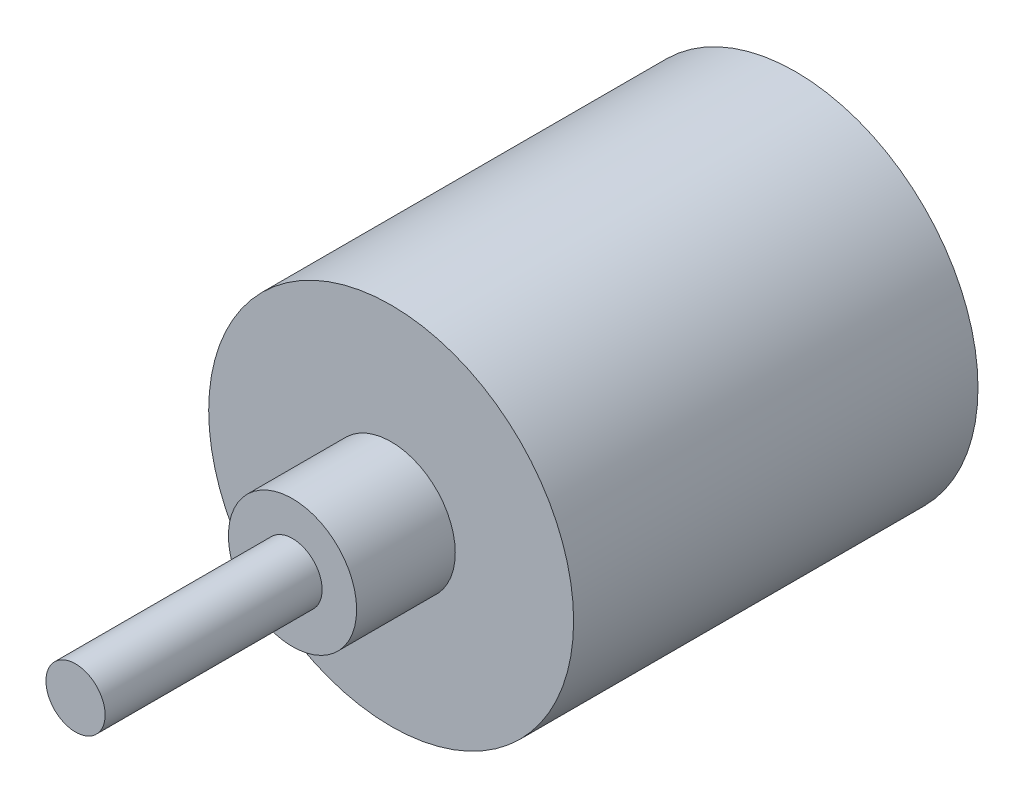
ISO-10303-21;
HEADER;
FILE_DESCRIPTION(('STEP AP214'),'2;1');
FILE_NAME('part.step','',(''),(''),'','','');
FILE_SCHEMA(('AUTOMOTIVE_DESIGN { 1 0 10303 214 1 1 1 1 }'));
ENDSEC;
DATA;
#1=APPLICATION_CONTEXT('core data for automotive mechanical design processes');
#2=APPLICATION_PROTOCOL_DEFINITION('international standard','automotive_design',2000,#1);
#3=PRODUCT_CONTEXT('',#1,'mechanical');
#4=PRODUCT('Part','Part','',(#3));
#5=PRODUCT_RELATED_PRODUCT_CATEGORY('part','',(#4));
#6=PRODUCT_DEFINITION_FORMATION('','',#4);
#7=PRODUCT_DEFINITION_CONTEXT('part definition',#1,'design');
#8=PRODUCT_DEFINITION('design','',#6,#7);
#9=PRODUCT_DEFINITION_SHAPE('','',#8);
#10=(LENGTH_UNIT() NAMED_UNIT(*) SI_UNIT(.MILLI.,.METRE.));
#11=(NAMED_UNIT(*) PLANE_ANGLE_UNIT() SI_UNIT($,.RADIAN.));
#12=(NAMED_UNIT(*) SI_UNIT($,.STERADIAN.) SOLID_ANGLE_UNIT());
#13=UNCERTAINTY_MEASURE_WITH_UNIT(LENGTH_MEASURE(1.E-05),#10,'distance_accuracy_value','');
#14=(GEOMETRIC_REPRESENTATION_CONTEXT(3) GLOBAL_UNCERTAINTY_ASSIGNED_CONTEXT((#13)) GLOBAL_UNIT_ASSIGNED_CONTEXT((#10,
#11,#12)) REPRESENTATION_CONTEXT('',''));
#15=CARTESIAN_POINT('',(0.,0.,0.));
#16=DIRECTION('',(0.,0.,1.));
#17=DIRECTION('',(1.,0.,0.));
#18=AXIS2_PLACEMENT_3D('',#15,#16,#17);
#19=CARTESIAN_POINT('',(0.,0.,41.));
#20=DIRECTION('',(0.,0.,-1.));
#21=DIRECTION('',(-1.,0.,0.));
#22=AXIS2_PLACEMENT_3D('',#19,#20,#21);
#23=CYLINDRICAL_SURFACE('',#22,18.5);
#24=CARTESIAN_POINT('',(0.,0.,41.));
#25=DIRECTION('',(0.,0.,1.));
#26=DIRECTION('',(1.,0.,0.));
#27=AXIS2_PLACEMENT_3D('',#24,#25,#26);
#28=CIRCLE('',#27,18.5);
#29=CARTESIAN_POINT('',(18.5,0.,41.));
#30=VERTEX_POINT('',#29);
#31=EDGE_CURVE('E43',#30,#30,#28,.T.);
#32=ORIENTED_EDGE('',*,*,#31,.F.);
#33=EDGE_LOOP('',(#32));
#34=FACE_BOUND('',#33,.T.);
#35=CARTESIAN_POINT('',(0.,0.,0.));
#36=DIRECTION('',(0.,0.,1.));
#37=DIRECTION('',(1.,0.,0.));
#38=AXIS2_PLACEMENT_3D('',#35,#36,#37);
#39=CIRCLE('',#38,18.5);
#40=CARTESIAN_POINT('',(18.5,0.,0.));
#41=VERTEX_POINT('',#40);
#42=EDGE_CURVE('E34',#41,#41,#39,.T.);
#43=ORIENTED_EDGE('',*,*,#42,.T.);
#44=EDGE_LOOP('',(#43));
#45=FACE_BOUND('',#44,.T.);
#46=ADVANCED_FACE('F31',(#34,#45),#23,.T.);
#47=CARTESIAN_POINT('',(0.,0.,41.));
#48=DIRECTION('',(0.,0.,1.));
#49=DIRECTION('',(1.,0.,0.));
#50=AXIS2_PLACEMENT_3D('',#47,#48,#49);
#51=PLANE('',#50);
#52=CARTESIAN_POINT('',(0.,0.,41.));
#53=DIRECTION('',(0.,0.,1.));
#54=DIRECTION('',(1.,0.,0.));
#55=AXIS2_PLACEMENT_3D('',#52,#53,#54);
#56=CIRCLE('',#55,6.5);
#57=CARTESIAN_POINT('',(6.5,0.,41.));
#58=VERTEX_POINT('',#57);
#59=EDGE_CURVE('E38',#58,#58,#56,.T.);
#60=ORIENTED_EDGE('',*,*,#59,.F.);
#61=EDGE_LOOP('',(#60));
#62=FACE_BOUND('',#61,.T.);
#63=ORIENTED_EDGE('',*,*,#31,.T.);
#64=EDGE_LOOP('',(#63));
#65=FACE_BOUND('',#64,.T.);
#66=ADVANCED_FACE('F60',(#62,#65),#51,.T.);
#67=CARTESIAN_POINT('',(0.,0.,0.));
#68=DIRECTION('',(0.,0.,1.));
#69=DIRECTION('',(1.,0.,0.));
#70=AXIS2_PLACEMENT_3D('',#67,#68,#69);
#71=PLANE('',#70);
#72=ORIENTED_EDGE('',*,*,#42,.F.);
#73=EDGE_LOOP('',(#72));
#74=FACE_BOUND('',#73,.T.);
#75=ADVANCED_FACE('F57',(#74),#71,.F.);
#76=CARTESIAN_POINT('',(0.,0.,51.));
#77=DIRECTION('',(0.,0.,-1.));
#78=DIRECTION('',(-1.,0.,0.));
#79=AXIS2_PLACEMENT_3D('',#76,#77,#78);
#80=CYLINDRICAL_SURFACE('',#79,6.5);
#81=CARTESIAN_POINT('',(0.,0.,51.));
#82=DIRECTION('',(0.,0.,1.));
#83=DIRECTION('',(1.,0.,0.));
#84=AXIS2_PLACEMENT_3D('',#81,#82,#83);
#85=CIRCLE('',#84,6.5);
#86=CARTESIAN_POINT('',(6.5,0.,51.));
#87=VERTEX_POINT('',#86);
#88=EDGE_CURVE('E48',#87,#87,#85,.T.);
#89=ORIENTED_EDGE('',*,*,#88,.F.);
#90=EDGE_LOOP('',(#89));
#91=FACE_BOUND('',#90,.T.);
#92=ORIENTED_EDGE('',*,*,#59,.T.);
#93=EDGE_LOOP('',(#92));
#94=FACE_BOUND('',#93,.T.);
#95=ADVANCED_FACE('F59',(#91,#94),#80,.T.);
#96=CARTESIAN_POINT('',(0.,0.,51.));
#97=DIRECTION('',(0.,0.,1.));
#98=DIRECTION('',(1.,0.,0.));
#99=AXIS2_PLACEMENT_3D('',#96,#97,#98);
#100=PLANE('',#99);
#101=CARTESIAN_POINT('',(0.,0.,51.));
#102=DIRECTION('',(0.,0.,1.));
#103=DIRECTION('',(1.,0.,0.));
#104=AXIS2_PLACEMENT_3D('',#101,#102,#103);
#105=CIRCLE('',#104,3.);
#106=CARTESIAN_POINT('',(3.,0.,51.));
#107=VERTEX_POINT('',#106);
#108=EDGE_CURVE('E10',#107,#107,#105,.T.);
#109=ORIENTED_EDGE('',*,*,#108,.F.);
#110=EDGE_LOOP('',(#109));
#111=FACE_BOUND('',#110,.T.);
#112=ORIENTED_EDGE('',*,*,#88,.T.);
#113=EDGE_LOOP('',(#112));
#114=FACE_BOUND('',#113,.T.);
#115=ADVANCED_FACE('F65',(#111,#114),#100,.T.);
#116=CARTESIAN_POINT('',(0.,0.,73.));
#117=DIRECTION('',(0.,0.,-1.));
#118=DIRECTION('',(-1.,0.,0.));
#119=AXIS2_PLACEMENT_3D('',#116,#117,#118);
#120=CYLINDRICAL_SURFACE('',#119,3.);
#121=CARTESIAN_POINT('',(0.,0.,73.));
#122=DIRECTION('',(0.,0.,1.));
#123=DIRECTION('',(1.,0.,0.));
#124=AXIS2_PLACEMENT_3D('',#121,#122,#123);
#125=CIRCLE('',#124,3.);
#126=CARTESIAN_POINT('',(3.,0.,73.));
#127=VERTEX_POINT('',#126);
#128=EDGE_CURVE('E47',#127,#127,#125,.T.);
#129=ORIENTED_EDGE('',*,*,#128,.F.);
#130=EDGE_LOOP('',(#129));
#131=FACE_BOUND('',#130,.T.);
#132=ORIENTED_EDGE('',*,*,#108,.T.);
#133=EDGE_LOOP('',(#132));
#134=FACE_BOUND('',#133,.T.);
#135=ADVANCED_FACE('F95',(#131,#134),#120,.T.);
#136=CARTESIAN_POINT('',(0.,0.,73.));
#137=DIRECTION('',(0.,0.,1.));
#138=DIRECTION('',(1.,0.,0.));
#139=AXIS2_PLACEMENT_3D('',#136,#137,#138);
#140=PLANE('',#139);
#141=ORIENTED_EDGE('',*,*,#128,.T.);
#142=EDGE_LOOP('',(#141));
#143=FACE_BOUND('',#142,.T.);
#144=ADVANCED_FACE('F105',(#143),#140,.T.);
#145=CLOSED_SHELL('',(#46,#66,#75,#95,#115,#135,#144));
#146=MANIFOLD_SOLID_BREP('B2',#145);
#147=ADVANCED_BREP_SHAPE_REPRESENTATION('',(#18,#146),#14);
#148=SHAPE_DEFINITION_REPRESENTATION(#9,#147);
ENDSEC;
END-ISO-10303-21;
